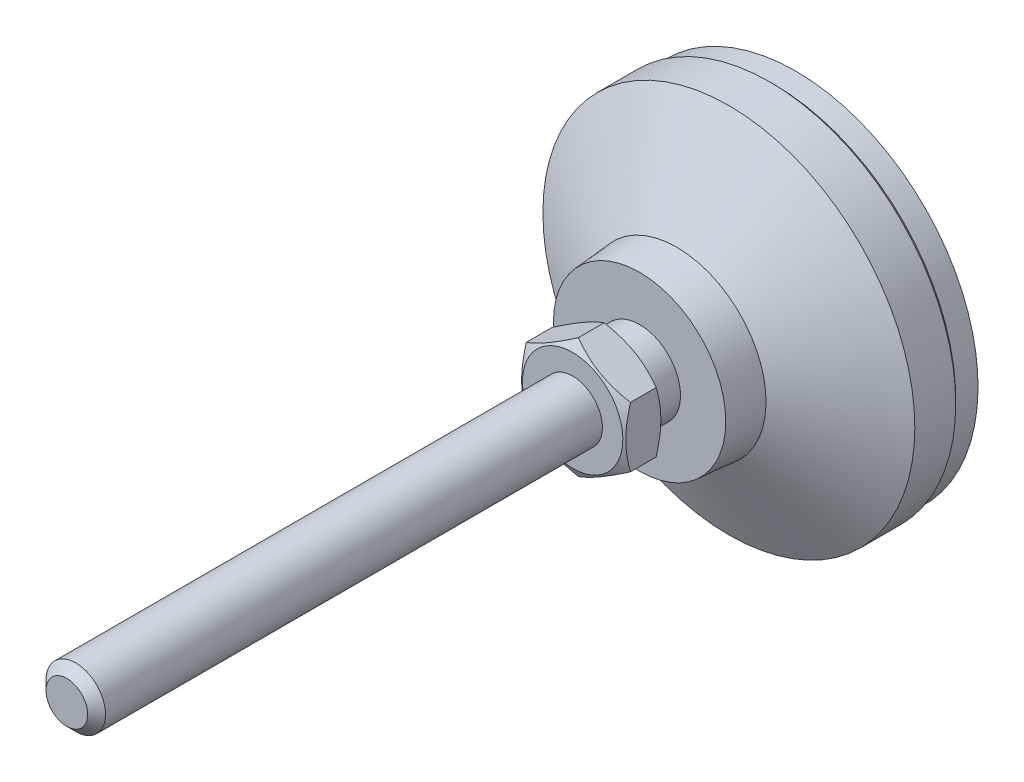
ISO-10303-21;
HEADER;
FILE_DESCRIPTION(('STEP AP214'),'2;1');
FILE_NAME('part.step','',(''),(''),'','','');
FILE_SCHEMA(('AUTOMOTIVE_DESIGN { 1 0 10303 214 1 1 1 1 }'));
ENDSEC;
DATA;
#1=APPLICATION_CONTEXT('core data for automotive mechanical design processes');
#2=APPLICATION_PROTOCOL_DEFINITION('international standard','automotive_design',2000,#1);
#3=PRODUCT_CONTEXT('',#1,'mechanical');
#4=PRODUCT('Part','Part','',(#3));
#5=PRODUCT_RELATED_PRODUCT_CATEGORY('part','',(#4));
#6=PRODUCT_DEFINITION_FORMATION('','',#4);
#7=PRODUCT_DEFINITION_CONTEXT('part definition',#1,'design');
#8=PRODUCT_DEFINITION('design','',#6,#7);
#9=PRODUCT_DEFINITION_SHAPE('','',#8);
#10=(LENGTH_UNIT() NAMED_UNIT(*) SI_UNIT(.MILLI.,.METRE.));
#11=(NAMED_UNIT(*) PLANE_ANGLE_UNIT() SI_UNIT($,.RADIAN.));
#12=(NAMED_UNIT(*) SI_UNIT($,.STERADIAN.) SOLID_ANGLE_UNIT());
#13=UNCERTAINTY_MEASURE_WITH_UNIT(LENGTH_MEASURE(1.E-05),#10,'distance_accuracy_value','');
#14=(GEOMETRIC_REPRESENTATION_CONTEXT(3) GLOBAL_UNCERTAINTY_ASSIGNED_CONTEXT((#13)) GLOBAL_UNIT_ASSIGNED_CONTEXT((#10,
#11,#12)) REPRESENTATION_CONTEXT('',''));
#15=CARTESIAN_POINT('',(0.,0.,0.));
#16=DIRECTION('',(0.,0.,1.));
#17=DIRECTION('',(1.,0.,0.));
#18=AXIS2_PLACEMENT_3D('',#15,#16,#17);
#19=CARTESIAN_POINT('',(0.,0.,2.));
#20=DIRECTION('',(0.,0.,-1.));
#21=DIRECTION('',(0.,1.,0.));
#22=AXIS2_PLACEMENT_3D('',#19,#20,#21);
#23=CYLINDRICAL_SURFACE('',#22,5.49999999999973);
#24=CARTESIAN_POINT('',(0.,0.,25.));
#25=DIRECTION('',(0.,0.,-1.));
#26=DIRECTION('',(0.,1.,0.));
#27=AXIS2_PLACEMENT_3D('',#24,#25,#26);
#28=CIRCLE('',#27,5.49999999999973);
#29=CARTESIAN_POINT('',(0.,5.49999999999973,25.));
#30=VERTEX_POINT('',#29);
#31=EDGE_CURVE('E100',#30,#30,#28,.T.);
#32=ORIENTED_EDGE('',*,*,#31,.T.);
#33=EDGE_LOOP('',(#32));
#34=FACE_BOUND('',#33,.T.);
#35=CARTESIAN_POINT('',(0.,0.,21.));
#36=DIRECTION('',(0.,0.,-1.));
#37=DIRECTION('',(0.,1.,0.));
#38=AXIS2_PLACEMENT_3D('',#35,#36,#37);
#39=CIRCLE('',#38,5.49999999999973);
#40=CARTESIAN_POINT('',(0.,5.49999999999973,21.));
#41=VERTEX_POINT('',#40);
#42=EDGE_CURVE('E93',#41,#41,#39,.T.);
#43=ORIENTED_EDGE('',*,*,#42,.F.);
#44=EDGE_LOOP('',(#43));
#45=FACE_BOUND('',#44,.T.);
#46=ADVANCED_FACE('F14',(#34,#45),#23,.T.);
#47=CARTESIAN_POINT('',(-5.49999999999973,0.,25.));
#48=DIRECTION('',(0.,0.,1.));
#49=DIRECTION('',(0.,-1.,0.));
#50=AXIS2_PLACEMENT_3D('',#47,#48,#49);
#51=PLANE('',#50);
#52=CARTESIAN_POINT('',(0.,0.,25.));
#53=DIRECTION('',(0.,0.,1.));
#54=DIRECTION('',(0.,-1.,0.));
#55=AXIS2_PLACEMENT_3D('',#52,#53,#54);
#56=CIRCLE('',#55,6.75);
#57=CARTESIAN_POINT('',(0.,-6.75,25.));
#58=VERTEX_POINT('',#57);
#59=EDGE_CURVE('E443',#58,#58,#56,.T.);
#60=ORIENTED_EDGE('',*,*,#59,.F.);
#61=EDGE_LOOP('',(#60));
#62=FACE_BOUND('',#61,.T.);
#63=ORIENTED_EDGE('',*,*,#31,.F.);
#64=EDGE_LOOP('',(#63));
#65=FACE_BOUND('',#64,.T.);
#66=ADVANCED_FACE('F137',(#62,#65),#51,.F.);
#67=CARTESIAN_POINT('',(0.,-5.49999999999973,21.));
#68=DIRECTION('',(0.,0.,1.));
#69=DIRECTION('',(0.,-1.,0.));
#70=AXIS2_PLACEMENT_3D('',#67,#68,#69);
#71=PLANE('',#70);
#72=ORIENTED_EDGE('',*,*,#42,.T.);
#73=EDGE_LOOP('',(#72));
#74=FACE_BOUND('',#73,.T.);
#75=CARTESIAN_POINT('',(0.,0.,21.));
#76=DIRECTION('',(0.,0.,1.));
#77=DIRECTION('',(0.,-1.,0.));
#78=AXIS2_PLACEMENT_3D('',#75,#76,#77);
#79=CIRCLE('',#78,11.5833333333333);
#80=CARTESIAN_POINT('',(0.,-11.5833333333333,21.));
#81=VERTEX_POINT('',#80);
#82=EDGE_CURVE('E88',#81,#81,#79,.T.);
#83=ORIENTED_EDGE('',*,*,#82,.T.);
#84=EDGE_LOOP('',(#83));
#85=FACE_BOUND('',#84,.T.);
#86=ADVANCED_FACE('F144',(#74,#85),#71,.T.);
#87=CARTESIAN_POINT('',(0.,0.,2.));
#88=DIRECTION('',(0.,0.,-1.));
#89=DIRECTION('',(0.,1.,0.));
#90=AXIS2_PLACEMENT_3D('',#87,#88,#89);
#91=CYLINDRICAL_SURFACE('',#90,25.);
#92=CARTESIAN_POINT('',(0.,0.,3.5));
#93=DIRECTION('',(0.,0.,-1.));
#94=DIRECTION('',(0.,1.,0.));
#95=AXIS2_PLACEMENT_3D('',#92,#93,#94);
#96=CIRCLE('',#95,25.);
#97=CARTESIAN_POINT('',(0.,25.,3.5));
#98=VERTEX_POINT('',#97);
#99=EDGE_CURVE('E28',#98,#98,#96,.F.);
#100=ORIENTED_EDGE('',*,*,#99,.T.);
#101=EDGE_LOOP('',(#100));
#102=FACE_BOUND('',#101,.T.);
#103=CARTESIAN_POINT('',(0.,0.,9.));
#104=DIRECTION('',(0.,0.,-1.));
#105=DIRECTION('',(0.,1.,0.));
#106=AXIS2_PLACEMENT_3D('',#103,#104,#105);
#107=CIRCLE('',#106,25.);
#108=CARTESIAN_POINT('',(0.,25.,9.));
#109=VERTEX_POINT('',#108);
#110=EDGE_CURVE('E106',#109,#109,#107,.T.);
#111=ORIENTED_EDGE('',*,*,#110,.T.);
#112=EDGE_LOOP('',(#111));
#113=FACE_BOUND('',#112,.T.);
#114=ADVANCED_FACE('F114',(#102,#113),#91,.T.);
#115=CARTESIAN_POINT('',(0.,0.,16.));
#116=DIRECTION('',(0.,0.,-1.));
#117=DIRECTION('',(0.,1.,0.));
#118=AXIS2_PLACEMENT_3D('',#115,#116,#117);
#119=CONICAL_SURFACE('',#118,12.,1.07685495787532);
#120=ORIENTED_EDGE('',*,*,#110,.F.);
#121=EDGE_LOOP('',(#120));
#122=FACE_BOUND('',#121,.T.);
#123=CARTESIAN_POINT('',(0.,0.,16.));
#124=DIRECTION('',(0.,0.,-1.));
#125=DIRECTION('',(0.,1.,0.));
#126=AXIS2_PLACEMENT_3D('',#123,#124,#125);
#127=CIRCLE('',#126,12.);
#128=CARTESIAN_POINT('',(0.,12.,16.));
#129=VERTEX_POINT('',#128);
#130=EDGE_CURVE('E103',#129,#129,#127,.T.);
#131=ORIENTED_EDGE('',*,*,#130,.T.);
#132=EDGE_LOOP('',(#131));
#133=FACE_BOUND('',#132,.T.);
#134=ADVANCED_FACE('F152',(#122,#133),#119,.T.);
#135=CARTESIAN_POINT('',(0.,0.,22.));
#136=DIRECTION('',(0.,0.,-1.));
#137=DIRECTION('',(0.,1.,0.));
#138=AXIS2_PLACEMENT_3D('',#135,#136,#137);
#139=CONICAL_SURFACE('',#138,11.5,0.0831412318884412);
#140=ORIENTED_EDGE('',*,*,#130,.F.);
#141=EDGE_LOOP('',(#140));
#142=FACE_BOUND('',#141,.T.);
#143=ORIENTED_EDGE('',*,*,#82,.F.);
#144=EDGE_LOOP('',(#143));
#145=FACE_BOUND('',#144,.T.);
#146=ADVANCED_FACE('F120',(#142,#145),#139,.T.);
#147=CARTESIAN_POINT('',(0.,0.,3.));
#148=DIRECTION('',(0.,0.,1.));
#149=DIRECTION('',(0.,-1.,0.));
#150=AXIS2_PLACEMENT_3D('',#147,#148,#149);
#151=CONICAL_SURFACE('',#150,24.5,0.785398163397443);
#152=ORIENTED_EDGE('',*,*,#99,.F.);
#153=EDGE_LOOP('',(#152));
#154=FACE_BOUND('',#153,.T.);
#155=CARTESIAN_POINT('',(0.,0.,3.));
#156=DIRECTION('',(0.,0.,-1.));
#157=DIRECTION('',(0.,1.,0.));
#158=AXIS2_PLACEMENT_3D('',#155,#156,#157);
#159=CIRCLE('',#158,24.5);
#160=CARTESIAN_POINT('',(0.,24.5,3.));
#161=VERTEX_POINT('',#160);
#162=EDGE_CURVE('E108',#161,#161,#159,.T.);
#163=ORIENTED_EDGE('',*,*,#162,.F.);
#164=EDGE_LOOP('',(#163));
#165=FACE_BOUND('',#164,.T.);
#166=ADVANCED_FACE('F16',(#154,#165),#151,.T.);
#167=CARTESIAN_POINT('',(0.,0.,0.));
#168=DIRECTION('',(0.,0.,1.));
#169=DIRECTION('',(0.,-1.,0.));
#170=AXIS2_PLACEMENT_3D('',#167,#168,#169);
#171=CYLINDRICAL_SURFACE('',#170,24.5);
#172=CARTESIAN_POINT('',(0.,0.,0.));
#173=DIRECTION('',(0.,0.,-1.));
#174=DIRECTION('',(0.,1.,0.));
#175=AXIS2_PLACEMENT_3D('',#172,#173,#174);
#176=CIRCLE('',#175,24.5);
#177=CARTESIAN_POINT('',(0.,24.5,0.));
#178=VERTEX_POINT('',#177);
#179=EDGE_CURVE('E260',#178,#178,#176,.T.);
#180=ORIENTED_EDGE('',*,*,#179,.F.);
#181=EDGE_LOOP('',(#180));
#182=FACE_BOUND('',#181,.T.);
#183=ORIENTED_EDGE('',*,*,#162,.T.);
#184=EDGE_LOOP('',(#183));
#185=FACE_BOUND('',#184,.T.);
#186=ADVANCED_FACE('F119',(#182,#185),#171,.T.);
#187=CARTESIAN_POINT('',(0.,0.,0.));
#188=DIRECTION('',(0.,0.,-1.));
#189=DIRECTION('',(0.,1.,0.));
#190=AXIS2_PLACEMENT_3D('',#187,#188,#189);
#191=PLANE('',#190);
#192=ORIENTED_EDGE('',*,*,#179,.T.);
#193=EDGE_LOOP('',(#192));
#194=FACE_BOUND('',#193,.T.);
#195=ADVANCED_FACE('F124',(#194),#191,.T.);
#196=CARTESIAN_POINT('',(0.,0.,25.));
#197=DIRECTION('',(0.,0.,1.));
#198=DIRECTION('',(0.,-1.,0.));
#199=AXIS2_PLACEMENT_3D('',#196,#197,#198);
#200=CONICAL_SURFACE('',#199,6.75,1.0471975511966);
#201=CARTESIAN_POINT('',(0.000200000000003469,-8.0830192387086,25.7696190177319));
#202=CARTESIAN_POINT('',(-0.15366790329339,-7.99418356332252,25.7183374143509));
#203=CARTESIAN_POINT('',(-0.308109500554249,-7.90501666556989,25.669383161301));
#204=CARTESIAN_POINT('',(-0.618246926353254,-7.72595873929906,25.5767703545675));
#205=CARTESIAN_POINT('',(-0.773943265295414,-7.63606741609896,25.5331140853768));
#206=CARTESIAN_POINT('',(-1.24352516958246,-7.36495417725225,25.4109491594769));
#207=CARTESIAN_POINT('',(-1.5592643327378,-7.18266208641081,25.3414631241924));
#208=CARTESIAN_POINT('',(-2.03176224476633,-6.90986528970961,25.2599825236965));
#209=CARTESIAN_POINT('',(-2.18710922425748,-6.82017566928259,25.2367710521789));
#210=CARTESIAN_POINT('',(-2.49850511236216,-6.64039116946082,25.1978487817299));
#211=CARTESIAN_POINT('',(-2.6545539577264,-6.55029632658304,25.1821373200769));
#212=CARTESIAN_POINT('',(-2.96692267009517,-6.36995016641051,25.1586154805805));
#213=CARTESIAN_POINT('',(-3.12324202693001,-6.27969914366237,25.1507961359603));
#214=CARTESIAN_POINT('',(-3.43601650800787,-6.09911871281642,25.1432178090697));
#215=CARTESIAN_POINT('',(-3.59247162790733,-6.00878930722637,25.1434585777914));
#216=CARTESIAN_POINT('',(-4.02110687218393,-5.76131663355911,25.155197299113));
#217=CARTESIAN_POINT('',(-4.29314668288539,-5.60425437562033,25.1749033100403));
#218=CARTESIAN_POINT('',(-4.83541944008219,-5.29117305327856,25.2373910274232));
#219=CARTESIAN_POINT('',(-5.10565047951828,-5.13515508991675,25.2801940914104));
#220=CARTESIAN_POINT('',(-5.64901454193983,-4.82144370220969,25.3871892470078));
#221=CARTESIAN_POINT('',(-5.92207900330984,-4.6637898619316,25.4518346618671));
#222=CARTESIAN_POINT('',(-6.46413578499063,-4.35083323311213,25.5985536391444));
#223=CARTESIAN_POINT('',(-6.73313504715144,-4.19552643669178,25.680592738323));
#224=CARTESIAN_POINT('',(-7.0002,-4.04133641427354,25.7696190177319));
#225=B_SPLINE_CURVE_WITH_KNOTS('',3,(#201,#202,#203,#204,#205,#206,#207,#208,#209,#210,#211,
#212,#213,#214,#215,#216,#217,#218,#219,#220,#221,#222,#223,#224),.UNSPECIFIED.,.F.,.F.,(4,2,2,
2,2,2,2,2,2,2,2,4),(0.,0.554727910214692,1.10969417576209,2.2219327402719,2.76443041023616,
3.30688013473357,3.84871284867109,4.39052882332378,5.33376515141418,6.27787517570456,
7.2429241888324,8.20607866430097),.UNSPECIFIED.);
#226=CARTESIAN_POINT('',(0.,-8.08290376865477,25.7695523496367));
#227=VERTEX_POINT('',#226);
#228=CARTESIAN_POINT('',(-7.,-4.04145188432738,25.7695523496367));
#229=VERTEX_POINT('',#228);
#230=EDGE_CURVE('E73',#227,#229,#225,.T.);
#231=ORIENTED_EDGE('',*,*,#230,.T.);
#232=CARTESIAN_POINT('',(-7.,10.8611447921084,28.5631016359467));
#233=CARTESIAN_POINT('',(-7.,10.5553635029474,28.4147489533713));
#234=CARTESIAN_POINT('',(-7.,10.2488808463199,28.2678171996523));
#235=CARTESIAN_POINT('',(-7.,9.63413982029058,27.9775946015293));
#236=CARTESIAN_POINT('',(-7.,9.32588118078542,27.8343043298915));
#237=CARTESIAN_POINT('',(-7.,8.70562954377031,27.5514440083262));
#238=CARTESIAN_POINT('',(-7.,8.39362535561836,27.4118984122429));
#239=CARTESIAN_POINT('',(-7.,7.76713731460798,27.1385107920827));
#240=CARTESIAN_POINT('',(-7.,7.45265357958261,27.0046684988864));
#241=CARTESIAN_POINT('',(-7.,6.81053581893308,26.7400011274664));
#242=CARTESIAN_POINT('',(-7.,6.48280417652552,26.609411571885));
#243=CARTESIAN_POINT('',(-7.,5.82350941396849,26.3581030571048));
#244=CARTESIAN_POINT('',(-7.,5.4919458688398,26.2373852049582));
#245=CARTESIAN_POINT('',(-7.,4.82507464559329,26.008985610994));
#246=CARTESIAN_POINT('',(-7.,4.48977608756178,25.9012775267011));
#247=CARTESIAN_POINT('',(-7.,3.81438128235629,25.7023487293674));
#248=CARTESIAN_POINT('',(-7.,3.47428658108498,25.6111228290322));
#249=CARTESIAN_POINT('',(-7.,2.79093814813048,25.4500242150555));
#250=CARTESIAN_POINT('',(-7.,2.44771250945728,25.3800355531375));
#251=CARTESIAN_POINT('',(-7.,1.92974425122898,25.294007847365));
#252=CARTESIAN_POINT('',(-7.,1.75655386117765,25.268489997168));
#253=CARTESIAN_POINT('',(-7.,1.4093104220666,25.2242731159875));
#254=CARTESIAN_POINT('',(-7.,1.2352574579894,25.2055734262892));
#255=CARTESIAN_POINT('',(-7.,0.888798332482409,25.175600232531));
#256=CARTESIAN_POINT('',(-7.,0.716400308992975,25.1642330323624));
#257=CARTESIAN_POINT('',(-7.,0.371278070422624,25.1487993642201));
#258=CARTESIAN_POINT('',(-7.,0.19855386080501,25.1447327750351));
#259=CARTESIAN_POINT('',(-7.,-0.146911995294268,25.1439973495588));
#260=CARTESIAN_POINT('',(-7.,-0.319653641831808,25.1473285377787));
#261=CARTESIAN_POINT('',(-7.,-0.664842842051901,25.1613072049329));
#262=CARTESIAN_POINT('',(-7.,-0.837290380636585,25.1719550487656));
#263=CARTESIAN_POINT('',(-7.,-1.25156928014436,25.2060982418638));
#264=CARTESIAN_POINT('',(-7.,-1.49312131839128,25.2330559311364));
#265=CARTESIAN_POINT('',(-7.,-1.97442477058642,25.2998573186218));
#266=CARTESIAN_POINT('',(-7.,-2.21417593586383,25.339702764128));
#267=CARTESIAN_POINT('',(-7.,-2.93045825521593,25.4764572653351));
#268=CARTESIAN_POINT('',(-7.,-3.40374984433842,25.5905594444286));
#269=CARTESIAN_POINT('',(-7.,-4.11145796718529,25.7883300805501));
#270=CARTESIAN_POINT('',(-7.,-4.34954757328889,25.8596098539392));
#271=CARTESIAN_POINT('',(-7.,-4.82341412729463,26.0095499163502));
#272=CARTESIAN_POINT('',(-7.,-5.05919105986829,26.0882102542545));
#273=CARTESIAN_POINT('',(-7.,-5.52850690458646,26.2516512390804));
#274=CARTESIAN_POINT('',(-7.,-5.7620465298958,26.3364298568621));
#275=CARTESIAN_POINT('',(-7.,-6.22719230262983,26.5111121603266));
#276=CARTESIAN_POINT('',(-7.,-6.45879847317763,26.6010157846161));
#277=CARTESIAN_POINT('',(-7.,-7.00730549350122,26.8198043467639));
#278=CARTESIAN_POINT('',(-7.,-7.32344040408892,26.9506060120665));
#279=CARTESIAN_POINT('',(-7.,-7.95300689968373,27.2185796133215));
#280=CARTESIAN_POINT('',(-7.,-8.26643831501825,27.3557519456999));
#281=CARTESIAN_POINT('',(-7.,-8.89109817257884,27.6351808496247));
#282=CARTESIAN_POINT('',(-7.,-9.20232614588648,27.7774384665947));
#283=CARTESIAN_POINT('',(-7.,-9.8228969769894,28.0660149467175));
#284=CARTESIAN_POINT('',(-7.,-10.1322397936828,28.2123338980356));
#285=CARTESIAN_POINT('',(-7.,-10.7496791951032,28.5084244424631));
#286=CARTESIAN_POINT('',(-7.,-11.0577740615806,28.6581996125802));
#287=CARTESIAN_POINT('',(-7.,-11.6726326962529,28.9604602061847));
#288=CARTESIAN_POINT('',(-7.,-11.9793964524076,29.1129456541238));
#289=CARTESIAN_POINT('',(-7.,-12.8979273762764,29.5737016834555));
#290=CARTESIAN_POINT('',(-7.,-13.5080186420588,29.8853127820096));
#291=CARTESIAN_POINT('',(-7.,-14.6735181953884,30.4881810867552));
#292=CARTESIAN_POINT('',(-7.,-15.2291894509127,30.7789321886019));
#293=CARTESIAN_POINT('',(-7.,-16.3384711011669,31.3643849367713));
#294=CARTESIAN_POINT('',(-7.,-16.8920814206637,31.6590867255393));
#295=CARTESIAN_POINT('',(-7.,-17.9962998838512,32.2507483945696));
#296=CARTESIAN_POINT('',(-7.,-18.546912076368,32.5477007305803));
#297=CARTESIAN_POINT('',(-7.,-19.6468201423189,33.1439612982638));
#298=CARTESIAN_POINT('',(-7.,-20.1961160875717,33.4432693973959));
#299=CARTESIAN_POINT('',(-7.,-20.7449282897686,33.7434559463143));
#300=B_SPLINE_CURVE_WITH_KNOTS('',3,(#232,#233,#234,#235,#236,#237,#238,#239,#240,#241,#242,
#243,#244,#245,#246,#247,#248,#249,#250,#251,#252,#253,#254,#255,#256,#257,#258,#259,#260,#261,
#262,#263,#264,#265,#266,#267,#268,#269,#270,#271,#272,#273,#274,#275,#276,#277,#278,#279,#280,
#281,#282,#283,#284,#285,#286,#287,#288,#289,#290,#291,#292,#293,#294,#295,#296,#297,#298,#299),
.UNSPECIFIED.,.F.,.F.,(4,2,2,2,2,2,2,2,2,2,2,2,2,2,2,2,2,2,2,2,2,2,2,2,2,2,2,2,2,2,2,2,2,4),(0.,
1.01961844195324,2.03939627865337,3.06471694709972,4.0899891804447,5.14823950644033,
6.20660834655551,7.2627969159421,8.31865249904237,9.36863520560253,9.89370270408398,
10.4187194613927,10.9368870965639,11.4550461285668,11.9732068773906,12.4913934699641,
13.2201367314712,13.9489788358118,15.4074680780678,16.1529979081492,16.8985326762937,
17.6438213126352,18.3891010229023,19.4153852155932,20.4417333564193,21.4682937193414,
22.4948763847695,23.5225739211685,24.5502807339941,26.6054130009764,28.4868212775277,
30.3682975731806,32.2450414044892,34.1216803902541),.UNSPECIFIED.);
#301=CARTESIAN_POINT('',(-7.,4.04145188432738,25.7695523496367));
#302=VERTEX_POINT('',#301);
#303=EDGE_CURVE('E81',#229,#302,#300,.F.);
#304=ORIENTED_EDGE('',*,*,#303,.T.);
#305=CARTESIAN_POINT('',(-7.0002,4.04133641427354,25.7696190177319));
#306=CARTESIAN_POINT('',(-6.84633209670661,4.13017208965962,25.7183374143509));
#307=CARTESIAN_POINT('',(-6.69189049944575,4.21933898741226,25.669383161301));
#308=CARTESIAN_POINT('',(-6.38175307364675,4.39839691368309,25.5767703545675));
#309=CARTESIAN_POINT('',(-6.22605673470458,4.48828823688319,25.5331140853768));
#310=CARTESIAN_POINT('',(-5.75647483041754,4.75940147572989,25.4109491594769));
#311=CARTESIAN_POINT('',(-5.4407356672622,4.94169356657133,25.3414631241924));
#312=CARTESIAN_POINT('',(-4.96823775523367,5.21449036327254,25.2599825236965));
#313=CARTESIAN_POINT('',(-4.81289077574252,5.30417998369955,25.2367710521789));
#314=CARTESIAN_POINT('',(-4.50149488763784,5.48396448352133,25.1978487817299));
#315=CARTESIAN_POINT('',(-4.34544604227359,5.57405932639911,25.1821373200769));
#316=CARTESIAN_POINT('',(-4.03307732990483,5.75440548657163,25.1586154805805));
#317=CARTESIAN_POINT('',(-3.87675797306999,5.84465650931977,25.1507961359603));
#318=CARTESIAN_POINT('',(-3.56398349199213,6.02523694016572,25.1432178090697));
#319=CARTESIAN_POINT('',(-3.40752837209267,6.11556634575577,25.1434585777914));
#320=CARTESIAN_POINT('',(-2.97889312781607,6.36303901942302,25.155197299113));
#321=CARTESIAN_POINT('',(-2.7068533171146,6.52010127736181,25.1749033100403));
#322=CARTESIAN_POINT('',(-2.16458055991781,6.83318259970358,25.2373910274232));
#323=CARTESIAN_POINT('',(-1.89434952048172,6.9892005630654,25.2801940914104));
#324=CARTESIAN_POINT('',(-1.35098545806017,7.30291195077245,25.3871892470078));
#325=CARTESIAN_POINT('',(-1.07792099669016,7.46056579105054,25.4518346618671));
#326=CARTESIAN_POINT('',(-0.535864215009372,7.77352241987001,25.5985536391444));
#327=CARTESIAN_POINT('',(-0.266864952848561,7.92882921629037,25.680592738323));
#328=CARTESIAN_POINT('',(0.000199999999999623,8.0830192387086,25.7696190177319));
#329=B_SPLINE_CURVE_WITH_KNOTS('',3,(#305,#306,#307,#308,#309,#310,#311,#312,#313,#314,#315,
#316,#317,#318,#319,#320,#321,#322,#323,#324,#325,#326,#327,#328),.UNSPECIFIED.,.F.,.F.,(4,2,2,
2,2,2,2,2,2,2,2,4),(0.,0.554727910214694,1.10969417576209,2.2219327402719,2.76443041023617,
3.30688013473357,3.84871284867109,4.39052882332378,5.33376515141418,6.27787517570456,
7.2429241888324,8.20607866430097),.UNSPECIFIED.);
#330=CARTESIAN_POINT('',(0.,8.08290376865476,25.7695523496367));
#331=VERTEX_POINT('',#330);
#332=EDGE_CURVE('E195',#302,#331,#329,.T.);
#333=ORIENTED_EDGE('',*,*,#332,.T.);
#334=CARTESIAN_POINT('',(-0.000200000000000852,8.0830192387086,25.7696190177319));
#335=CARTESIAN_POINT('',(0.153667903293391,7.99418356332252,25.7183374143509));
#336=CARTESIAN_POINT('',(0.30810950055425,7.90501666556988,25.669383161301));
#337=CARTESIAN_POINT('',(0.618246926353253,7.72595873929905,25.5767703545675));
#338=CARTESIAN_POINT('',(0.773943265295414,7.63606741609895,25.5331140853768));
#339=CARTESIAN_POINT('',(1.24352516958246,7.36495417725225,25.4109491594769));
#340=CARTESIAN_POINT('',(1.5592643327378,7.18266208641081,25.3414631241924));
#341=CARTESIAN_POINT('',(2.03176224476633,6.9098652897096,25.2599825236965));
#342=CARTESIAN_POINT('',(2.18710922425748,6.82017566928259,25.2367710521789));
#343=CARTESIAN_POINT('',(2.49850511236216,6.64039116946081,25.1978487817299));
#344=CARTESIAN_POINT('',(2.65455395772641,6.55029632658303,25.1821373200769));
#345=CARTESIAN_POINT('',(2.96692267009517,6.36995016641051,25.1586154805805));
#346=CARTESIAN_POINT('',(3.12324202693,6.27969914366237,25.1507961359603));
#347=CARTESIAN_POINT('',(3.43601650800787,6.09911871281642,25.1432178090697));
#348=CARTESIAN_POINT('',(3.59247162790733,6.00878930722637,25.1434585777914));
#349=CARTESIAN_POINT('',(4.02110687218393,5.76131663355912,25.155197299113));
#350=CARTESIAN_POINT('',(4.2931466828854,5.60425437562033,25.1749033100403));
#351=CARTESIAN_POINT('',(4.83541944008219,5.29117305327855,25.2373910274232));
#352=CARTESIAN_POINT('',(5.10565047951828,5.13515508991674,25.2801940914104));
#353=CARTESIAN_POINT('',(5.64901454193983,4.82144370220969,25.3871892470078));
#354=CARTESIAN_POINT('',(5.92207900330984,4.66378986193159,25.4518346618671));
#355=CARTESIAN_POINT('',(6.46413578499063,4.35083323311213,25.5985536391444));
#356=CARTESIAN_POINT('',(6.73313504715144,4.19552643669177,25.680592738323));
#357=CARTESIAN_POINT('',(7.0002,4.04133641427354,25.7696190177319));
#358=B_SPLINE_CURVE_WITH_KNOTS('',3,(#334,#335,#336,#337,#338,#339,#340,#341,#342,#343,#344,
#345,#346,#347,#348,#349,#350,#351,#352,#353,#354,#355,#356,#357),.UNSPECIFIED.,.F.,.F.,(4,2,2,
2,2,2,2,2,2,2,2,4),(0.,0.554727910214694,1.10969417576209,2.2219327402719,2.76443041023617,
3.30688013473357,3.84871284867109,4.39052882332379,5.33376515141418,6.27787517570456,
7.2429241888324,8.20607866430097),.UNSPECIFIED.);
#359=CARTESIAN_POINT('',(7.,4.04145188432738,25.7695523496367));
#360=VERTEX_POINT('',#359);
#361=EDGE_CURVE('E223',#331,#360,#358,.T.);
#362=ORIENTED_EDGE('',*,*,#361,.T.);
#363=CARTESIAN_POINT('',(7.,10.8611447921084,28.5631016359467));
#364=CARTESIAN_POINT('',(7.,10.5553635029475,28.4147489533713));
#365=CARTESIAN_POINT('',(7.,10.2488808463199,28.2678171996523));
#366=CARTESIAN_POINT('',(7.,9.6341398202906,27.9775946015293));
#367=CARTESIAN_POINT('',(7.,9.32588118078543,27.8343043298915));
#368=CARTESIAN_POINT('',(7.,8.70562954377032,27.5514440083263));
#369=CARTESIAN_POINT('',(7.,8.39362535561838,27.4118984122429));
#370=CARTESIAN_POINT('',(7.,7.76713731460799,27.1385107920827));
#371=CARTESIAN_POINT('',(7.,7.45265357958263,27.0046684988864));
#372=CARTESIAN_POINT('',(7.,6.81053581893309,26.7400011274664));
#373=CARTESIAN_POINT('',(7.,6.48280417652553,26.609411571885));
#374=CARTESIAN_POINT('',(7.,5.8235094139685,26.3581030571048));
#375=CARTESIAN_POINT('',(7.,5.49194586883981,26.2373852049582));
#376=CARTESIAN_POINT('',(7.,4.8250746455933,26.008985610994));
#377=CARTESIAN_POINT('',(7.,4.48977608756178,25.9012775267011));
#378=CARTESIAN_POINT('',(7.,3.8143812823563,25.7023487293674));
#379=CARTESIAN_POINT('',(7.,3.47428658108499,25.6111228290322));
#380=CARTESIAN_POINT('',(7.,2.79093814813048,25.4500242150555));
#381=CARTESIAN_POINT('',(7.,2.44771250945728,25.3800355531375));
#382=CARTESIAN_POINT('',(7.,1.92974425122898,25.294007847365));
#383=CARTESIAN_POINT('',(7.,1.75655386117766,25.268489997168));
#384=CARTESIAN_POINT('',(7.,1.4093104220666,25.2242731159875));
#385=CARTESIAN_POINT('',(7.,1.2352574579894,25.2055734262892));
#386=CARTESIAN_POINT('',(7.,0.888798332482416,25.175600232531));
#387=CARTESIAN_POINT('',(7.,0.716400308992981,25.1642330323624));
#388=CARTESIAN_POINT('',(7.,0.371278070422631,25.1487993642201));
#389=CARTESIAN_POINT('',(7.,0.198553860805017,25.1447327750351));
#390=CARTESIAN_POINT('',(7.,-0.14691199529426,25.1439973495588));
#391=CARTESIAN_POINT('',(7.,-0.319653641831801,25.1473285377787));
#392=CARTESIAN_POINT('',(7.,-0.664842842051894,25.1613072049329));
#393=CARTESIAN_POINT('',(7.,-0.837290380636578,25.1719550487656));
#394=CARTESIAN_POINT('',(7.,-1.25156928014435,25.2060982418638));
#395=CARTESIAN_POINT('',(7.,-1.49312131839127,25.2330559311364));
#396=CARTESIAN_POINT('',(7.,-1.97442477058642,25.2998573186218));
#397=CARTESIAN_POINT('',(7.,-2.21417593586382,25.339702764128));
#398=CARTESIAN_POINT('',(7.,-2.93045825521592,25.4764572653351));
#399=CARTESIAN_POINT('',(7.,-3.40374984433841,25.5905594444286));
#400=CARTESIAN_POINT('',(7.,-4.11145796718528,25.7883300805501));
#401=CARTESIAN_POINT('',(7.,-4.34954757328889,25.8596098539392));
#402=CARTESIAN_POINT('',(7.,-4.82341412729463,26.0095499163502));
#403=CARTESIAN_POINT('',(7.,-5.05919105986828,26.0882102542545));
#404=CARTESIAN_POINT('',(7.,-5.52850690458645,26.2516512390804));
#405=CARTESIAN_POINT('',(7.,-5.76204652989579,26.3364298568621));
#406=CARTESIAN_POINT('',(7.,-6.22719230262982,26.5111121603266));
#407=CARTESIAN_POINT('',(7.,-6.45879847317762,26.6010157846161));
#408=CARTESIAN_POINT('',(7.,-7.00730549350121,26.8198043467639));
#409=CARTESIAN_POINT('',(7.,-7.32344040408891,26.9506060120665));
#410=CARTESIAN_POINT('',(7.,-7.95300689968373,27.2185796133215));
#411=CARTESIAN_POINT('',(7.,-8.26643831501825,27.3557519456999));
#412=CARTESIAN_POINT('',(7.,-8.89109817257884,27.6351808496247));
#413=CARTESIAN_POINT('',(7.,-9.20232614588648,27.7774384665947));
#414=CARTESIAN_POINT('',(7.,-9.8228969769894,28.0660149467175));
#415=CARTESIAN_POINT('',(7.,-10.1322397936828,28.2123338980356));
#416=CARTESIAN_POINT('',(7.,-10.7496791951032,28.5084244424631));
#417=CARTESIAN_POINT('',(7.,-11.0577740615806,28.6581996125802));
#418=CARTESIAN_POINT('',(7.,-11.6726326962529,28.9604602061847));
#419=CARTESIAN_POINT('',(7.,-11.9793964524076,29.1129456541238));
#420=CARTESIAN_POINT('',(7.,-12.8979273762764,29.5737016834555));
#421=CARTESIAN_POINT('',(7.,-13.5080186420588,29.8853127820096));
#422=CARTESIAN_POINT('',(7.,-14.6735181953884,30.4881810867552));
#423=CARTESIAN_POINT('',(7.,-15.2291894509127,30.7789321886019));
#424=CARTESIAN_POINT('',(7.,-16.3384711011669,31.3643849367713));
#425=CARTESIAN_POINT('',(7.,-16.8920814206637,31.6590867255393));
#426=CARTESIAN_POINT('',(7.,-17.9962998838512,32.2507483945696));
#427=CARTESIAN_POINT('',(7.,-18.546912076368,32.5477007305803));
#428=CARTESIAN_POINT('',(7.,-19.6468201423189,33.1439612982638));
#429=CARTESIAN_POINT('',(7.,-20.1961160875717,33.4432693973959));
#430=CARTESIAN_POINT('',(7.,-20.7449282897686,33.7434559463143));
#431=B_SPLINE_CURVE_WITH_KNOTS('',3,(#363,#364,#365,#366,#367,#368,#369,#370,#371,#372,#373,
#374,#375,#376,#377,#378,#379,#380,#381,#382,#383,#384,#385,#386,#387,#388,#389,#390,#391,#392,
#393,#394,#395,#396,#397,#398,#399,#400,#401,#402,#403,#404,#405,#406,#407,#408,#409,#410,#411,
#412,#413,#414,#415,#416,#417,#418,#419,#420,#421,#422,#423,#424,#425,#426,#427,#428,#429,#430),
.UNSPECIFIED.,.F.,.F.,(4,2,2,2,2,2,2,2,2,2,2,2,2,2,2,2,2,2,2,2,2,2,2,2,2,2,2,2,2,2,2,2,2,4),(0.,
1.01961844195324,2.03939627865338,3.06471694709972,4.08998918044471,5.14823950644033,
6.20660834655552,7.26279691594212,8.31865249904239,9.36863520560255,9.89370270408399,
10.4187194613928,10.9368870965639,11.4550461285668,11.9732068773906,12.4913934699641,
13.2201367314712,13.9489788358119,15.4074680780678,16.1529979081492,16.8985326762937,
17.6438213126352,18.3891010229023,19.4153852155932,20.4417333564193,21.4682937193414,
22.4948763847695,23.5225739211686,24.5502807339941,26.6054130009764,28.4868212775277,
30.3682975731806,32.2450414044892,34.1216803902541),.UNSPECIFIED.);
#432=CARTESIAN_POINT('',(7.,-4.04145188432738,25.7695523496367));
#433=VERTEX_POINT('',#432);
#434=EDGE_CURVE('E34',#360,#433,#431,.T.);
#435=ORIENTED_EDGE('',*,*,#434,.T.);
#436=CARTESIAN_POINT('',(7.0002,-4.04133641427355,25.7696190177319));
#437=CARTESIAN_POINT('',(6.84633209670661,-4.13017208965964,25.7183374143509));
#438=CARTESIAN_POINT('',(6.69189049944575,-4.21933898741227,25.669383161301));
#439=CARTESIAN_POINT('',(6.38175307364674,-4.3983969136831,25.5767703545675));
#440=CARTESIAN_POINT('',(6.22605673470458,-4.4882882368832,25.5331140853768));
#441=CARTESIAN_POINT('',(5.75647483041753,-4.7594014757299,25.4109491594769));
#442=CARTESIAN_POINT('',(5.4407356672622,-4.94169356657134,25.3414631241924));
#443=CARTESIAN_POINT('',(4.96823775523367,-5.21449036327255,25.2599825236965));
#444=CARTESIAN_POINT('',(4.81289077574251,-5.30417998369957,25.2367710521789));
#445=CARTESIAN_POINT('',(4.50149488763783,-5.48396448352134,25.1978487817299));
#446=CARTESIAN_POINT('',(4.34544604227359,-5.57405932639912,25.1821373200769));
#447=CARTESIAN_POINT('',(4.03307732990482,-5.75440548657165,25.1586154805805));
#448=CARTESIAN_POINT('',(3.87675797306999,-5.84465650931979,25.1507961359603));
#449=CARTESIAN_POINT('',(3.56398349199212,-6.02523694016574,25.1432178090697));
#450=CARTESIAN_POINT('',(3.40752837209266,-6.11556634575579,25.1434585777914));
#451=CARTESIAN_POINT('',(2.97889312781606,-6.36303901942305,25.155197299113));
#452=CARTESIAN_POINT('',(2.7068533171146,-6.52010127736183,25.1749033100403));
#453=CARTESIAN_POINT('',(2.1645805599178,-6.8331825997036,25.2373910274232));
#454=CARTESIAN_POINT('',(1.89434952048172,-6.98920056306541,25.2801940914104));
#455=CARTESIAN_POINT('',(1.35098545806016,-7.30291195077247,25.3871892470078));
#456=CARTESIAN_POINT('',(1.07792099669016,-7.46056579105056,25.4518346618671));
#457=CARTESIAN_POINT('',(0.535864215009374,-7.77352241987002,25.5985536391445));
#458=CARTESIAN_POINT('',(0.266864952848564,-7.92882921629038,25.680592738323));
#459=CARTESIAN_POINT('',(-0.000199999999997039,-8.08301923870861,25.7696190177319));
#460=B_SPLINE_CURVE_WITH_KNOTS('',3,(#436,#437,#438,#439,#440,#441,#442,#443,#444,#445,#446,
#447,#448,#449,#450,#451,#452,#453,#454,#455,#456,#457,#458,#459),.UNSPECIFIED.,.F.,.F.,(4,2,2,
2,2,2,2,2,2,2,2,4),(0.,0.554727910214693,1.10969417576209,2.2219327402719,2.76443041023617,
3.30688013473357,3.8487128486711,4.39052882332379,5.33376515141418,6.27787517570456,
7.2429241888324,8.20607866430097),.UNSPECIFIED.);
#461=EDGE_CURVE('E9',#433,#227,#460,.T.);
#462=ORIENTED_EDGE('',*,*,#461,.T.);
#463=EDGE_LOOP('',(#231,#304,#333,#362,#435,#462));
#464=FACE_BOUND('',#463,.T.);
#465=ORIENTED_EDGE('',*,*,#59,.T.);
#466=EDGE_LOOP('',(#465));
#467=FACE_BOUND('',#466,.T.);
#468=ADVANCED_FACE('F71',(#464,#467),#200,.T.);
#469=CARTESIAN_POINT('',(0.,0.,98.));
#470=DIRECTION('',(0.,0.,-1.));
#471=DIRECTION('',(0.,1.,0.));
#472=AXIS2_PLACEMENT_3D('',#469,#470,#471);
#473=PLANE('',#472);
#474=CARTESIAN_POINT('',(0.,0.,98.));
#475=DIRECTION('',(0.,0.,-1.));
#476=DIRECTION('',(0.,1.,0.));
#477=AXIS2_PLACEMENT_3D('',#474,#475,#476);
#478=CIRCLE('',#477,2.79999999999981);
#479=CARTESIAN_POINT('',(0.,2.79999999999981,98.));
#480=VERTEX_POINT('',#479);
#481=EDGE_CURVE('E293',#480,#480,#478,.T.);
#482=ORIENTED_EDGE('',*,*,#481,.F.);
#483=EDGE_LOOP('',(#482));
#484=FACE_BOUND('',#483,.T.);
#485=ADVANCED_FACE('F170',(#484),#473,.F.);
#486=CARTESIAN_POINT('',(0.,0.,98.));
#487=DIRECTION('',(0.,0.,-1.));
#488=DIRECTION('',(0.,1.,0.));
#489=AXIS2_PLACEMENT_3D('',#486,#487,#488);
#490=CONICAL_SURFACE('',#489,2.79999999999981,0.785398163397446);
#491=CARTESIAN_POINT('',(0.,0.,96.8));
#492=DIRECTION('',(0.,0.,-1.));
#493=DIRECTION('',(0.,1.,0.));
#494=AXIS2_PLACEMENT_3D('',#491,#492,#493);
#495=CIRCLE('',#494,3.99999999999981);
#496=CARTESIAN_POINT('',(0.,3.99999999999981,96.8));
#497=VERTEX_POINT('',#496);
#498=EDGE_CURVE('E262',#497,#497,#495,.T.);
#499=ORIENTED_EDGE('',*,*,#498,.F.);
#500=EDGE_LOOP('',(#499));
#501=FACE_BOUND('',#500,.T.);
#502=ORIENTED_EDGE('',*,*,#481,.T.);
#503=EDGE_LOOP('',(#502));
#504=FACE_BOUND('',#503,.T.);
#505=ADVANCED_FACE('F277',(#501,#504),#490,.T.);
#506=CARTESIAN_POINT('',(0.,0.,2.));
#507=DIRECTION('',(0.,0.,-1.));
#508=DIRECTION('',(0.,1.,0.));
#509=AXIS2_PLACEMENT_3D('',#506,#507,#508);
#510=CYLINDRICAL_SURFACE('',#509,3.99999999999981);
#511=CARTESIAN_POINT('',(0.,0.,30.));
#512=DIRECTION('',(0.,0.,-1.));
#513=DIRECTION('',(0.,1.,0.));
#514=AXIS2_PLACEMENT_3D('',#511,#512,#513);
#515=CIRCLE('',#514,3.99999999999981);
#516=CARTESIAN_POINT('',(0.,3.99999999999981,30.));
#517=VERTEX_POINT('',#516);
#518=EDGE_CURVE('E97',#517,#517,#515,.T.);
#519=ORIENTED_EDGE('',*,*,#518,.F.);
#520=EDGE_LOOP('',(#519));
#521=FACE_BOUND('',#520,.T.);
#522=ORIENTED_EDGE('',*,*,#498,.T.);
#523=EDGE_LOOP('',(#522));
#524=FACE_BOUND('',#523,.T.);
#525=ADVANCED_FACE('F273',(#521,#524),#510,.T.);
#526=CARTESIAN_POINT('',(-3.99999999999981,0.,30.));
#527=DIRECTION('',(0.,0.,-1.));
#528=DIRECTION('',(0.,1.,0.));
#529=AXIS2_PLACEMENT_3D('',#526,#527,#528);
#530=PLANE('',#529);
#531=CARTESIAN_POINT('',(0.,0.,30.));
#532=DIRECTION('',(0.,0.,1.));
#533=DIRECTION('',(0.,-1.,0.));
#534=AXIS2_PLACEMENT_3D('',#531,#532,#533);
#535=CIRCLE('',#534,6.75);
#536=CARTESIAN_POINT('',(0.,-6.75,30.));
#537=VERTEX_POINT('',#536);
#538=EDGE_CURVE('E80',#537,#537,#535,.T.);
#539=ORIENTED_EDGE('',*,*,#538,.T.);
#540=EDGE_LOOP('',(#539));
#541=FACE_BOUND('',#540,.T.);
#542=ORIENTED_EDGE('',*,*,#518,.T.);
#543=EDGE_LOOP('',(#542));
#544=FACE_BOUND('',#543,.T.);
#545=ADVANCED_FACE('F276',(#541,#544),#530,.F.);
#546=CARTESIAN_POINT('',(0.,0.,28.0625741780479));
#547=DIRECTION('',(0.,0.,-1.));
#548=DIRECTION('',(0.,1.,0.));
#549=AXIS2_PLACEMENT_3D('',#546,#547,#548);
#550=CONICAL_SURFACE('',#549,10.105719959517,1.0471975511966);
#551=CARTESIAN_POINT('',(-7.0002,-4.04133641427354,29.2303809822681));
#552=CARTESIAN_POINT('',(-6.84633209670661,-4.13017208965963,29.2816625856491));
#553=CARTESIAN_POINT('',(-6.69189049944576,-4.21933898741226,29.330616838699));
#554=CARTESIAN_POINT('',(-6.38175307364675,-4.39839691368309,29.4232296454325));
#555=CARTESIAN_POINT('',(-6.22605673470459,-4.48828823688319,29.4668859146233));
#556=CARTESIAN_POINT('',(-5.75647483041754,-4.75940147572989,29.5890508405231));
#557=CARTESIAN_POINT('',(-5.4407356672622,-4.94169356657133,29.6585368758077));
#558=CARTESIAN_POINT('',(-4.96823775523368,-5.21449036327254,29.7400174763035));
#559=CARTESIAN_POINT('',(-4.81289077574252,-5.30417998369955,29.7632289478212));
#560=CARTESIAN_POINT('',(-4.50149488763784,-5.48396448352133,29.8021512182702));
#561=CARTESIAN_POINT('',(-4.3454460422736,-5.57405932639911,29.8178626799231));
#562=CARTESIAN_POINT('',(-4.03307732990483,-5.75440548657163,29.8413845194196));
#563=CARTESIAN_POINT('',(-3.87675797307,-5.84465650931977,29.8492038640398));
#564=CARTESIAN_POINT('',(-3.56398349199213,-6.02523694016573,29.8567821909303));
#565=CARTESIAN_POINT('',(-3.40752837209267,-6.11556634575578,29.8565414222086));
#566=CARTESIAN_POINT('',(-2.97889312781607,-6.36303901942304,29.844802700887));
#567=CARTESIAN_POINT('',(-2.7068533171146,-6.52010127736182,29.8250966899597));
#568=CARTESIAN_POINT('',(-2.1645805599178,-6.83318259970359,29.7626089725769));
#569=CARTESIAN_POINT('',(-1.89434952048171,-6.98920056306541,29.7198059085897));
#570=CARTESIAN_POINT('',(-1.35098545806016,-7.30291195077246,29.6128107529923));
#571=CARTESIAN_POINT('',(-1.07792099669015,-7.46056579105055,29.548165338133));
#572=CARTESIAN_POINT('',(-0.535864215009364,-7.77352241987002,29.4014463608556));
#573=CARTESIAN_POINT('',(-0.266864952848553,-7.92882921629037,29.3194072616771));
#574=CARTESIAN_POINT('',(0.000200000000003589,-8.0830192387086,29.2303809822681));
#575=B_SPLINE_CURVE_WITH_KNOTS('',3,(#551,#552,#553,#554,#555,#556,#557,#558,#559,#560,#561,
#562,#563,#564,#565,#566,#567,#568,#569,#570,#571,#572,#573,#574),.UNSPECIFIED.,.F.,.F.,(4,2,2,
2,2,2,2,2,2,2,2,4),(0.,0.5547279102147,1.1096941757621,2.2219327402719,2.76443041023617,
3.30688013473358,3.8487128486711,4.3905288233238,5.3337651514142,6.27787517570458,
7.24292418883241,8.20607866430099),.UNSPECIFIED.);
#576=CARTESIAN_POINT('',(-7.,-4.04145188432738,29.2304476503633));
#577=VERTEX_POINT('',#576);
#578=CARTESIAN_POINT('',(0.,-8.08290376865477,29.2304476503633));
#579=VERTEX_POINT('',#578);
#580=EDGE_CURVE('E259',#577,#579,#575,.T.);
#581=ORIENTED_EDGE('',*,*,#580,.T.);
#582=CARTESIAN_POINT('',(-0.000199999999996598,-8.08301923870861,29.2303809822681));
#583=CARTESIAN_POINT('',(0.15366790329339,-7.99418356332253,29.2816625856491));
#584=CARTESIAN_POINT('',(0.308109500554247,-7.9050166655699,29.330616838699));
#585=CARTESIAN_POINT('',(0.618246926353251,-7.72595873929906,29.4232296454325));
#586=CARTESIAN_POINT('',(0.773943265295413,-7.63606741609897,29.4668859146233));
#587=CARTESIAN_POINT('',(1.24352516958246,-7.36495417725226,29.5890508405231));
#588=CARTESIAN_POINT('',(1.5592643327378,-7.18266208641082,29.6585368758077));
#589=CARTESIAN_POINT('',(2.03176224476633,-6.90986528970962,29.7400174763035));
#590=CARTESIAN_POINT('',(2.18710922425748,-6.8201756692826,29.7632289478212));
#591=CARTESIAN_POINT('',(2.49850511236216,-6.64039116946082,29.8021512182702));
#592=CARTESIAN_POINT('',(2.65455395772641,-6.55029632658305,29.8178626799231));
#593=CARTESIAN_POINT('',(2.96692267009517,-6.36995016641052,29.8413845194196));
#594=CARTESIAN_POINT('',(3.12324202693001,-6.27969914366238,29.8492038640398));
#595=CARTESIAN_POINT('',(3.43601650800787,-6.09911871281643,29.8567821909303));
#596=CARTESIAN_POINT('',(3.59247162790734,-6.00878930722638,29.8565414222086));
#597=CARTESIAN_POINT('',(4.02110687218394,-5.76131663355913,29.844802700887));
#598=CARTESIAN_POINT('',(4.2931466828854,-5.60425437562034,29.8250966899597));
#599=CARTESIAN_POINT('',(4.8354194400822,-5.29117305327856,29.7626089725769));
#600=CARTESIAN_POINT('',(5.10565047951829,-5.13515508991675,29.7198059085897));
#601=CARTESIAN_POINT('',(5.64901454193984,-4.82144370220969,29.6128107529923));
#602=CARTESIAN_POINT('',(5.92207900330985,-4.6637898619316,29.548165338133));
#603=CARTESIAN_POINT('',(6.46413578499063,-4.35083323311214,29.4014463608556));
#604=CARTESIAN_POINT('',(6.73313504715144,-4.19552643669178,29.3194072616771));
#605=CARTESIAN_POINT('',(7.0002,-4.04133641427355,29.2303809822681));
#606=B_SPLINE_CURVE_WITH_KNOTS('',3,(#582,#583,#584,#585,#586,#587,#588,#589,#590,#591,#592,
#593,#594,#595,#596,#597,#598,#599,#600,#601,#602,#603,#604,#605),.UNSPECIFIED.,.F.,.F.,(4,2,2,
2,2,2,2,2,2,2,2,4),(0.,0.554727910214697,1.1096941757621,2.2219327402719,2.76443041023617,
3.30688013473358,3.8487128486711,4.3905288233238,5.3337651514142,6.27787517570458,
7.24292418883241,8.20607866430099),.UNSPECIFIED.);
#607=CARTESIAN_POINT('',(7.,-4.04145188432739,29.2304476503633));
#608=VERTEX_POINT('',#607);
#609=EDGE_CURVE('E86',#579,#608,#606,.T.);
#610=ORIENTED_EDGE('',*,*,#609,.T.);
#611=CARTESIAN_POINT('',(7.,10.8611447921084,26.4368983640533));
#612=CARTESIAN_POINT('',(7.,10.5553635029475,26.5852510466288));
#613=CARTESIAN_POINT('',(7.,10.2488808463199,26.7321828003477));
#614=CARTESIAN_POINT('',(7.,9.63413982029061,27.0224053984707));
#615=CARTESIAN_POINT('',(7.,9.32588118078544,27.1656956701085));
#616=CARTESIAN_POINT('',(7.,8.70562954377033,27.4485559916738));
#617=CARTESIAN_POINT('',(7.,8.39362535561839,27.5881015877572));
#618=CARTESIAN_POINT('',(7.,7.76713731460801,27.8614892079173));
#619=CARTESIAN_POINT('',(7.,7.45265357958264,27.9953315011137));
#620=CARTESIAN_POINT('',(7.,6.8105358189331,28.2599988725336));
#621=CARTESIAN_POINT('',(7.,6.48280417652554,28.3905884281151));
#622=CARTESIAN_POINT('',(7.,5.82350941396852,28.6418969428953));
#623=CARTESIAN_POINT('',(7.,5.49194586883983,28.7626147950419));
#624=CARTESIAN_POINT('',(7.,4.82507464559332,28.9910143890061));
#625=CARTESIAN_POINT('',(7.,4.4897760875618,29.098722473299));
#626=CARTESIAN_POINT('',(7.,3.81438128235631,29.2976512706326));
#627=CARTESIAN_POINT('',(7.,3.47428658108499,29.3888771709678));
#628=CARTESIAN_POINT('',(7.,2.79093814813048,29.5499757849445));
#629=CARTESIAN_POINT('',(7.,2.44771250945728,29.6199644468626));
#630=CARTESIAN_POINT('',(7.,1.92974425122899,29.705992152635));
#631=CARTESIAN_POINT('',(7.,1.75655386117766,29.7315100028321));
#632=CARTESIAN_POINT('',(7.,1.4093104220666,29.7757268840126));
#633=CARTESIAN_POINT('',(7.,1.23525745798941,29.7944265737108));
#634=CARTESIAN_POINT('',(7.,0.888798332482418,29.8243997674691));
#635=CARTESIAN_POINT('',(7.,0.716400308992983,29.8357669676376));
#636=CARTESIAN_POINT('',(7.,0.371278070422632,29.8512006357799));
#637=CARTESIAN_POINT('',(7.,0.198553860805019,29.855267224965));
#638=CARTESIAN_POINT('',(7.,-0.146911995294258,29.8560026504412));
#639=CARTESIAN_POINT('',(7.,-0.319653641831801,29.8526714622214));
#640=CARTESIAN_POINT('',(7.,-0.664842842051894,29.8386927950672));
#641=CARTESIAN_POINT('',(7.,-0.837290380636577,29.8280449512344));
#642=CARTESIAN_POINT('',(7.,-1.25156928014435,29.7939017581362));
#643=CARTESIAN_POINT('',(7.,-1.49312131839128,29.7669440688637));
#644=CARTESIAN_POINT('',(7.,-1.97442477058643,29.7001426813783));
#645=CARTESIAN_POINT('',(7.,-2.21417593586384,29.6602972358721));
#646=CARTESIAN_POINT('',(7.,-2.93045825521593,29.5235427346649));
#647=CARTESIAN_POINT('',(7.,-3.40374984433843,29.4094405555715));
#648=CARTESIAN_POINT('',(7.,-4.1114579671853,29.2116699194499));
#649=CARTESIAN_POINT('',(7.,-4.3495475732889,29.1403901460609));
#650=CARTESIAN_POINT('',(7.,-4.82341412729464,28.9904500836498));
#651=CARTESIAN_POINT('',(7.,-5.05919105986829,28.9117897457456));
#652=CARTESIAN_POINT('',(7.,-5.52850690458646,28.7483487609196));
#653=CARTESIAN_POINT('',(7.,-5.76204652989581,28.663570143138));
#654=CARTESIAN_POINT('',(7.,-6.22719230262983,28.4888878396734));
#655=CARTESIAN_POINT('',(7.,-6.45879847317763,28.3989842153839));
#656=CARTESIAN_POINT('',(7.,-7.00730549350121,28.180195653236));
#657=CARTESIAN_POINT('',(7.,-7.32344040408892,28.0493939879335));
#658=CARTESIAN_POINT('',(7.,-7.95300689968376,27.7814203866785));
#659=CARTESIAN_POINT('',(7.,-8.26643831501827,27.6442480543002));
#660=CARTESIAN_POINT('',(7.,-8.89109817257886,27.3648191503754));
#661=CARTESIAN_POINT('',(7.,-9.2023261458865,27.2225615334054));
#662=CARTESIAN_POINT('',(7.,-9.82289697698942,26.9339850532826));
#663=CARTESIAN_POINT('',(7.,-10.1322397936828,26.7876661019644));
#664=CARTESIAN_POINT('',(7.,-10.7496791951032,26.4915755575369));
#665=CARTESIAN_POINT('',(7.,-11.0577740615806,26.3418003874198));
#666=CARTESIAN_POINT('',(7.,-11.6726326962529,26.0395397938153));
#667=CARTESIAN_POINT('',(7.,-11.9793964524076,25.8870543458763));
#668=CARTESIAN_POINT('',(7.,-12.8979273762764,25.4262983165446));
#669=CARTESIAN_POINT('',(7.,-13.5080186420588,25.1146872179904));
#670=CARTESIAN_POINT('',(7.,-14.6735181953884,24.5118189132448));
#671=CARTESIAN_POINT('',(7.,-15.2291894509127,24.2210678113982));
#672=CARTESIAN_POINT('',(7.,-16.3384711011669,23.6356150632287));
#673=CARTESIAN_POINT('',(7.,-16.8920814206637,23.3409132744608));
#674=CARTESIAN_POINT('',(7.,-17.9962998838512,22.7492516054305));
#675=CARTESIAN_POINT('',(7.,-18.546912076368,22.4522992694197));
#676=CARTESIAN_POINT('',(7.,-19.6468201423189,21.8560387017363));
#677=CARTESIAN_POINT('',(7.,-20.1961160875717,21.5567306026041));
#678=CARTESIAN_POINT('',(7.,-20.7449282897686,21.2565440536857));
#679=B_SPLINE_CURVE_WITH_KNOTS('',3,(#611,#612,#613,#614,#615,#616,#617,#618,#619,#620,#621,
#622,#623,#624,#625,#626,#627,#628,#629,#630,#631,#632,#633,#634,#635,#636,#637,#638,#639,#640,
#641,#642,#643,#644,#645,#646,#647,#648,#649,#650,#651,#652,#653,#654,#655,#656,#657,#658,#659,
#660,#661,#662,#663,#664,#665,#666,#667,#668,#669,#670,#671,#672,#673,#674,#675,#676,#677,#678),
.UNSPECIFIED.,.F.,.F.,(4,2,2,2,2,2,2,2,2,2,2,2,2,2,2,2,2,2,2,2,2,2,2,2,2,2,2,2,2,2,2,2,2,4),(0.,
1.01961844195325,2.03939627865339,3.06471694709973,4.08998918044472,5.14823950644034,
6.20660834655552,7.26279691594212,8.3186524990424,9.36863520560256,9.893702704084,
10.4187194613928,10.936887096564,11.4550461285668,11.9732068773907,12.4913934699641,
13.2201367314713,13.9489788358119,15.4074680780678,16.1529979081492,16.8985326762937,
17.6438213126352,18.3891010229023,19.4153852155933,20.4417333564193,21.4682937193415,
22.4948763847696,23.5225739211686,24.5502807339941,26.6054130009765,28.4868212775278,
30.3682975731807,32.2450414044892,34.1216803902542),.UNSPECIFIED.);
#680=CARTESIAN_POINT('',(7.,4.04145188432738,29.2304476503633));
#681=VERTEX_POINT('',#680);
#682=EDGE_CURVE('E244',#608,#681,#679,.F.);
#683=ORIENTED_EDGE('',*,*,#682,.T.);
#684=CARTESIAN_POINT('',(7.0002,4.04133641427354,29.2303809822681));
#685=CARTESIAN_POINT('',(6.84633209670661,4.13017208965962,29.2816625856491));
#686=CARTESIAN_POINT('',(6.69189049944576,4.21933898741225,29.330616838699));
#687=CARTESIAN_POINT('',(6.38175307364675,4.39839691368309,29.4232296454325));
#688=CARTESIAN_POINT('',(6.22605673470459,4.48828823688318,29.4668859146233));
#689=CARTESIAN_POINT('',(5.75647483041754,4.75940147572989,29.5890508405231));
#690=CARTESIAN_POINT('',(5.44073566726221,4.94169356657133,29.6585368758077));
#691=CARTESIAN_POINT('',(4.96823775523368,5.21449036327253,29.7400174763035));
#692=CARTESIAN_POINT('',(4.81289077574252,5.30417998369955,29.7632289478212));
#693=CARTESIAN_POINT('',(4.50149488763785,5.48396448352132,29.8021512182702));
#694=CARTESIAN_POINT('',(4.3454460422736,5.5740593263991,29.8178626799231));
#695=CARTESIAN_POINT('',(4.03307732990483,5.75440548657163,29.8413845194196));
#696=CARTESIAN_POINT('',(3.87675797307,5.84465650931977,29.8492038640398));
#697=CARTESIAN_POINT('',(3.56398349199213,6.02523694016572,29.8567821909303));
#698=CARTESIAN_POINT('',(3.40752837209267,6.11556634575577,29.8565414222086));
#699=CARTESIAN_POINT('',(2.97889312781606,6.36303901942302,29.844802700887));
#700=CARTESIAN_POINT('',(2.7068533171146,6.52010127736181,29.8250966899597));
#701=CARTESIAN_POINT('',(2.1645805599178,6.83318259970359,29.7626089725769));
#702=CARTESIAN_POINT('',(1.89434952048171,6.9892005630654,29.7198059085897));
#703=CARTESIAN_POINT('',(1.35098545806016,7.30291195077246,29.6128107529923));
#704=CARTESIAN_POINT('',(1.07792099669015,7.46056579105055,29.548165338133));
#705=CARTESIAN_POINT('',(0.535864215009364,7.77352241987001,29.4014463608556));
#706=CARTESIAN_POINT('',(0.266864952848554,7.92882921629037,29.3194072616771));
#707=CARTESIAN_POINT('',(-0.000200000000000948,8.0830192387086,29.2303809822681));
#708=B_SPLINE_CURVE_WITH_KNOTS('',3,(#684,#685,#686,#687,#688,#689,#690,#691,#692,#693,#694,
#695,#696,#697,#698,#699,#700,#701,#702,#703,#704,#705,#706,#707),.UNSPECIFIED.,.F.,.F.,(4,2,2,
2,2,2,2,2,2,2,2,4),(0.,0.554727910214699,1.1096941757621,2.2219327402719,2.76443041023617,
3.30688013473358,3.8487128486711,4.3905288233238,5.3337651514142,6.27787517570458,
7.24292418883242,8.206078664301),.UNSPECIFIED.);
#709=CARTESIAN_POINT('',(0.,8.08290376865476,29.2304476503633));
#710=VERTEX_POINT('',#709);
#711=EDGE_CURVE('E236',#681,#710,#708,.T.);
#712=ORIENTED_EDGE('',*,*,#711,.T.);
#713=CARTESIAN_POINT('',(0.000199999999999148,8.0830192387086,29.2303809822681));
#714=CARTESIAN_POINT('',(-0.153667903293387,7.99418356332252,29.2816625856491));
#715=CARTESIAN_POINT('',(-0.308109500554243,7.90501666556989,29.330616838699));
#716=CARTESIAN_POINT('',(-0.618246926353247,7.72595873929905,29.4232296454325));
#717=CARTESIAN_POINT('',(-0.77394326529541,7.63606741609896,29.4668859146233));
#718=CARTESIAN_POINT('',(-1.24352516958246,7.36495417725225,29.5890508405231));
#719=CARTESIAN_POINT('',(-1.55926433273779,7.18266208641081,29.6585368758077));
#720=CARTESIAN_POINT('',(-2.03176224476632,6.90986528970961,29.7400174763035));
#721=CARTESIAN_POINT('',(-2.18710922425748,6.82017566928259,29.7632289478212));
#722=CARTESIAN_POINT('',(-2.49850511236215,6.64039116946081,29.8021512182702));
#723=CARTESIAN_POINT('',(-2.6545539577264,6.55029632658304,29.8178626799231));
#724=CARTESIAN_POINT('',(-2.96692267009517,6.36995016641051,29.8413845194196));
#725=CARTESIAN_POINT('',(-3.12324202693,6.27969914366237,29.8492038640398));
#726=CARTESIAN_POINT('',(-3.43601650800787,6.09911871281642,29.8567821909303));
#727=CARTESIAN_POINT('',(-3.59247162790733,6.00878930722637,29.8565414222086));
#728=CARTESIAN_POINT('',(-4.02110687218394,5.76131663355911,29.844802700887));
#729=CARTESIAN_POINT('',(-4.2931466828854,5.60425437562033,29.8250966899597));
#730=CARTESIAN_POINT('',(-4.8354194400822,5.29117305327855,29.7626089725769));
#731=CARTESIAN_POINT('',(-5.10565047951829,5.13515508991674,29.7198059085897));
#732=CARTESIAN_POINT('',(-5.64901454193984,4.82144370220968,29.6128107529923));
#733=CARTESIAN_POINT('',(-5.92207900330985,4.66378986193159,29.548165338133));
#734=CARTESIAN_POINT('',(-6.46413578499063,4.35083323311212,29.4014463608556));
#735=CARTESIAN_POINT('',(-6.73313504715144,4.19552643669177,29.3194072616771));
#736=CARTESIAN_POINT('',(-7.0002,4.04133641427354,29.2303809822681));
#737=B_SPLINE_CURVE_WITH_KNOTS('',3,(#713,#714,#715,#716,#717,#718,#719,#720,#721,#722,#723,
#724,#725,#726,#727,#728,#729,#730,#731,#732,#733,#734,#735,#736),.UNSPECIFIED.,.F.,.F.,(4,2,2,
2,2,2,2,2,2,2,2,4),(0.,0.554727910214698,1.1096941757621,2.2219327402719,2.76443041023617,
3.30688013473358,3.8487128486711,4.3905288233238,5.3337651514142,6.27787517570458,
7.24292418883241,8.20607866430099),.UNSPECIFIED.);
#738=CARTESIAN_POINT('',(-7.,4.04145188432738,29.2304476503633));
#739=VERTEX_POINT('',#738);
#740=EDGE_CURVE('E243',#710,#739,#737,.T.);
#741=ORIENTED_EDGE('',*,*,#740,.T.);
#742=CARTESIAN_POINT('',(-7.,10.8611447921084,26.4368983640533));
#743=CARTESIAN_POINT('',(-7.,10.5553635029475,26.5852510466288));
#744=CARTESIAN_POINT('',(-7.,10.2488808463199,26.7321828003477));
#745=CARTESIAN_POINT('',(-7.,9.6341398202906,27.0224053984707));
#746=CARTESIAN_POINT('',(-7.,9.32588118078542,27.1656956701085));
#747=CARTESIAN_POINT('',(-7.,8.70562954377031,27.4485559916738));
#748=CARTESIAN_POINT('',(-7.,8.39362535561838,27.5881015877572));
#749=CARTESIAN_POINT('',(-7.,7.76713731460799,27.8614892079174));
#750=CARTESIAN_POINT('',(-7.,7.45265357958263,27.9953315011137));
#751=CARTESIAN_POINT('',(-7.,6.81053581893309,28.2599988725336));
#752=CARTESIAN_POINT('',(-7.,6.48280417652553,28.3905884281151));
#753=CARTESIAN_POINT('',(-7.,5.82350941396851,28.6418969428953));
#754=CARTESIAN_POINT('',(-7.,5.49194586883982,28.7626147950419));
#755=CARTESIAN_POINT('',(-7.,4.82507464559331,28.9910143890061));
#756=CARTESIAN_POINT('',(-7.,4.48977608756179,29.098722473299));
#757=CARTESIAN_POINT('',(-7.,3.8143812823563,29.2976512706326));
#758=CARTESIAN_POINT('',(-7.,3.47428658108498,29.3888771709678));
#759=CARTESIAN_POINT('',(-7.,2.79093814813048,29.5499757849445));
#760=CARTESIAN_POINT('',(-7.,2.44771250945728,29.6199644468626));
#761=CARTESIAN_POINT('',(-7.,1.92974425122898,29.705992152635));
#762=CARTESIAN_POINT('',(-7.,1.75655386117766,29.7315100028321));
#763=CARTESIAN_POINT('',(-7.,1.4093104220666,29.7757268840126));
#764=CARTESIAN_POINT('',(-7.,1.2352574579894,29.7944265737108));
#765=CARTESIAN_POINT('',(-7.,0.888798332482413,29.8243997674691));
#766=CARTESIAN_POINT('',(-7.,0.716400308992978,29.8357669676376));
#767=CARTESIAN_POINT('',(-7.,0.371278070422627,29.8512006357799));
#768=CARTESIAN_POINT('',(-7.,0.198553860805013,29.855267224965));
#769=CARTESIAN_POINT('',(-7.,-0.146911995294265,29.8560026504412));
#770=CARTESIAN_POINT('',(-7.,-0.319653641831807,29.8526714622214));
#771=CARTESIAN_POINT('',(-7.,-0.6648428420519,29.8386927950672));
#772=CARTESIAN_POINT('',(-7.,-0.837290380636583,29.8280449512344));
#773=CARTESIAN_POINT('',(-7.,-1.25156928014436,29.7939017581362));
#774=CARTESIAN_POINT('',(-7.,-1.49312131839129,29.7669440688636));
#775=CARTESIAN_POINT('',(-7.,-1.97442477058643,29.7001426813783));
#776=CARTESIAN_POINT('',(-7.,-2.21417593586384,29.6602972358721));
#777=CARTESIAN_POINT('',(-7.,-2.93045825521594,29.5235427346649));
#778=CARTESIAN_POINT('',(-7.,-3.40374984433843,29.4094405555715));
#779=CARTESIAN_POINT('',(-7.,-4.1114579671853,29.2116699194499));
#780=CARTESIAN_POINT('',(-7.,-4.34954757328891,29.1403901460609));
#781=CARTESIAN_POINT('',(-7.,-4.82341412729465,28.9904500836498));
#782=CARTESIAN_POINT('',(-7.,-5.0591910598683,28.9117897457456));
#783=CARTESIAN_POINT('',(-7.,-5.52850690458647,28.7483487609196));
#784=CARTESIAN_POINT('',(-7.,-5.76204652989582,28.663570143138));
#785=CARTESIAN_POINT('',(-7.,-6.22719230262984,28.4888878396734));
#786=CARTESIAN_POINT('',(-7.,-6.45879847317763,28.3989842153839));
#787=CARTESIAN_POINT('',(-7.,-7.00730549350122,28.180195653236));
#788=CARTESIAN_POINT('',(-7.,-7.32344040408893,28.0493939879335));
#789=CARTESIAN_POINT('',(-7.,-7.95300689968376,27.7814203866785));
#790=CARTESIAN_POINT('',(-7.,-8.26643831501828,27.6442480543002));
#791=CARTESIAN_POINT('',(-7.,-8.89109817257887,27.3648191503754));
#792=CARTESIAN_POINT('',(-7.,-9.20232614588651,27.2225615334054));
#793=CARTESIAN_POINT('',(-7.,-9.82289697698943,26.9339850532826));
#794=CARTESIAN_POINT('',(-7.,-10.1322397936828,26.7876661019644));
#795=CARTESIAN_POINT('',(-7.,-10.7496791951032,26.4915755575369));
#796=CARTESIAN_POINT('',(-7.,-11.0577740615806,26.3418003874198));
#797=CARTESIAN_POINT('',(-7.,-11.6726326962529,26.0395397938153));
#798=CARTESIAN_POINT('',(-7.,-11.9793964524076,25.8870543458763));
#799=CARTESIAN_POINT('',(-7.,-12.8979273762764,25.4262983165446));
#800=CARTESIAN_POINT('',(-7.,-13.5080186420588,25.1146872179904));
#801=CARTESIAN_POINT('',(-7.,-14.6735181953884,24.5118189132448));
#802=CARTESIAN_POINT('',(-7.,-15.2291894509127,24.2210678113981));
#803=CARTESIAN_POINT('',(-7.,-16.338471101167,23.6356150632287));
#804=CARTESIAN_POINT('',(-7.,-16.8920814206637,23.3409132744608));
#805=CARTESIAN_POINT('',(-7.,-17.9962998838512,22.7492516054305));
#806=CARTESIAN_POINT('',(-7.,-18.546912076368,22.4522992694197));
#807=CARTESIAN_POINT('',(-7.,-19.6468201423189,21.8560387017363));
#808=CARTESIAN_POINT('',(-7.,-20.1961160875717,21.5567306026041));
#809=CARTESIAN_POINT('',(-7.,-20.7449282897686,21.2565440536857));
#810=B_SPLINE_CURVE_WITH_KNOTS('',3,(#742,#743,#744,#745,#746,#747,#748,#749,#750,#751,#752,
#753,#754,#755,#756,#757,#758,#759,#760,#761,#762,#763,#764,#765,#766,#767,#768,#769,#770,#771,
#772,#773,#774,#775,#776,#777,#778,#779,#780,#781,#782,#783,#784,#785,#786,#787,#788,#789,#790,
#791,#792,#793,#794,#795,#796,#797,#798,#799,#800,#801,#802,#803,#804,#805,#806,#807,#808,#809),
.UNSPECIFIED.,.F.,.F.,(4,2,2,2,2,2,2,2,2,2,2,2,2,2,2,2,2,2,2,2,2,2,2,2,2,2,2,2,2,2,2,2,2,4),(0.,
1.01961844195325,2.03939627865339,3.06471694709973,4.08998918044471,5.14823950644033,
6.20660834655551,7.26279691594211,8.31865249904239,9.36863520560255,9.89370270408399,
10.4187194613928,10.9368870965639,11.4550461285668,11.9732068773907,12.4913934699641,
13.2201367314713,13.9489788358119,15.4074680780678,16.1529979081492,16.8985326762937,
17.6438213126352,18.3891010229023,19.4153852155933,20.4417333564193,21.4682937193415,
22.4948763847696,23.5225739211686,24.5502807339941,26.6054130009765,28.4868212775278,
30.3682975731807,32.2450414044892,34.1216803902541),.UNSPECIFIED.);
#811=EDGE_CURVE('E181',#739,#577,#810,.T.);
#812=ORIENTED_EDGE('',*,*,#811,.T.);
#813=EDGE_LOOP('',(#581,#610,#683,#712,#741,#812));
#814=FACE_BOUND('',#813,.T.);
#815=ORIENTED_EDGE('',*,*,#538,.F.);
#816=EDGE_LOOP('',(#815));
#817=FACE_BOUND('',#816,.T.);
#818=ADVANCED_FACE('F209',(#814,#817),#550,.T.);
#819=CARTESIAN_POINT('',(0.,-8.08290376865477,25.));
#820=DIRECTION('',(0.5,-0.866025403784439,0.));
#821=DIRECTION('',(0.866025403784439,0.5,0.));
#822=AXIS2_PLACEMENT_3D('',#819,#820,#821);
#823=PLANE('',#822);
#824=ORIENTED_EDGE('',*,*,#461,.F.);
#825=DIRECTION('',(0.,0.,1.));
#826=VECTOR('',#825,1.);
#827=CARTESIAN_POINT('',(7.,-4.04145188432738,25.));
#828=LINE('',#827,#826);
#829=EDGE_CURVE('E87',#433,#608,#828,.T.);
#830=ORIENTED_EDGE('',*,*,#829,.T.);
#831=ORIENTED_EDGE('',*,*,#609,.F.);
#832=DIRECTION('',(0.,0.,1.));
#833=VECTOR('',#832,1.);
#834=CARTESIAN_POINT('',(0.,-8.08290376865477,25.));
#835=LINE('',#834,#833);
#836=EDGE_CURVE('E42',#227,#579,#835,.T.);
#837=ORIENTED_EDGE('',*,*,#836,.F.);
#838=EDGE_LOOP('',(#824,#830,#831,#837));
#839=FACE_BOUND('',#838,.T.);
#840=ADVANCED_FACE('F84',(#839),#823,.T.);
#841=CARTESIAN_POINT('',(7.,-4.04145188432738,25.));
#842=DIRECTION('',(1.,0.,0.));
#843=DIRECTION('',(0.,1.,0.));
#844=AXIS2_PLACEMENT_3D('',#841,#842,#843);
#845=PLANE('',#844);
#846=ORIENTED_EDGE('',*,*,#434,.F.);
#847=DIRECTION('',(0.,0.,1.));
#848=VECTOR('',#847,1.);
#849=CARTESIAN_POINT('',(7.,4.04145188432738,25.));
#850=LINE('',#849,#848);
#851=EDGE_CURVE('E90',#360,#681,#850,.T.);
#852=ORIENTED_EDGE('',*,*,#851,.T.);
#853=ORIENTED_EDGE('',*,*,#682,.F.);
#854=ORIENTED_EDGE('',*,*,#829,.F.);
#855=EDGE_LOOP('',(#846,#852,#853,#854));
#856=FACE_BOUND('',#855,.T.);
#857=ADVANCED_FACE('F231',(#856),#845,.T.);
#858=CARTESIAN_POINT('',(7.,4.04145188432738,25.));
#859=DIRECTION('',(0.5,0.866025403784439,0.));
#860=DIRECTION('',(-0.866025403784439,0.5,0.));
#861=AXIS2_PLACEMENT_3D('',#858,#859,#860);
#862=PLANE('',#861);
#863=ORIENTED_EDGE('',*,*,#361,.F.);
#864=DIRECTION('',(0.,0.,1.));
#865=VECTOR('',#864,1.);
#866=CARTESIAN_POINT('',(0.,8.08290376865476,25.));
#867=LINE('',#866,#865);
#868=EDGE_CURVE('E301',#331,#710,#867,.T.);
#869=ORIENTED_EDGE('',*,*,#868,.T.);
#870=ORIENTED_EDGE('',*,*,#711,.F.);
#871=ORIENTED_EDGE('',*,*,#851,.F.);
#872=EDGE_LOOP('',(#863,#869,#870,#871));
#873=FACE_BOUND('',#872,.T.);
#874=ADVANCED_FACE('F228',(#873),#862,.T.);
#875=CARTESIAN_POINT('',(0.,8.08290376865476,25.));
#876=DIRECTION('',(-0.5,0.866025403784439,0.));
#877=DIRECTION('',(-0.866025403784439,-0.5,0.));
#878=AXIS2_PLACEMENT_3D('',#875,#876,#877);
#879=PLANE('',#878);
#880=ORIENTED_EDGE('',*,*,#332,.F.);
#881=DIRECTION('',(0.,0.,1.));
#882=VECTOR('',#881,1.);
#883=CARTESIAN_POINT('',(-7.,4.04145188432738,25.));
#884=LINE('',#883,#882);
#885=EDGE_CURVE('E299',#302,#739,#884,.T.);
#886=ORIENTED_EDGE('',*,*,#885,.T.);
#887=ORIENTED_EDGE('',*,*,#740,.F.);
#888=ORIENTED_EDGE('',*,*,#868,.F.);
#889=EDGE_LOOP('',(#880,#886,#887,#888));
#890=FACE_BOUND('',#889,.T.);
#891=ADVANCED_FACE('F175',(#890),#879,.T.);
#892=CARTESIAN_POINT('',(-7.,4.04145188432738,25.));
#893=DIRECTION('',(-1.,0.,0.));
#894=DIRECTION('',(0.,-1.,0.));
#895=AXIS2_PLACEMENT_3D('',#892,#893,#894);
#896=PLANE('',#895);
#897=ORIENTED_EDGE('',*,*,#303,.F.);
#898=DIRECTION('',(0.,0.,1.));
#899=VECTOR('',#898,1.);
#900=CARTESIAN_POINT('',(-7.,-4.04145188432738,25.));
#901=LINE('',#900,#899);
#902=EDGE_CURVE('E79',#229,#577,#901,.T.);
#903=ORIENTED_EDGE('',*,*,#902,.T.);
#904=ORIENTED_EDGE('',*,*,#811,.F.);
#905=ORIENTED_EDGE('',*,*,#885,.F.);
#906=EDGE_LOOP('',(#897,#903,#904,#905));
#907=FACE_BOUND('',#906,.T.);
#908=ADVANCED_FACE('F171',(#907),#896,.T.);
#909=CARTESIAN_POINT('',(-7.,-4.04145188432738,25.));
#910=DIRECTION('',(-0.5,-0.866025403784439,0.));
#911=DIRECTION('',(0.866025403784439,-0.5,0.));
#912=AXIS2_PLACEMENT_3D('',#909,#910,#911);
#913=PLANE('',#912);
#914=ORIENTED_EDGE('',*,*,#230,.F.);
#915=ORIENTED_EDGE('',*,*,#836,.T.);
#916=ORIENTED_EDGE('',*,*,#580,.F.);
#917=ORIENTED_EDGE('',*,*,#902,.F.);
#918=EDGE_LOOP('',(#914,#915,#916,#917));
#919=FACE_BOUND('',#918,.T.);
#920=ADVANCED_FACE('F78',(#919),#913,.T.);
#921=CLOSED_SHELL('',(#46,#66,#86,#114,#134,#146,#166,#186,#195,#468,#485,#505,#525,#545,#818,
#840,#857,#874,#891,#908,#920));
#922=MANIFOLD_SOLID_BREP('B1',#921);
#923=ADVANCED_BREP_SHAPE_REPRESENTATION('',(#18,#922),#14);
#924=SHAPE_DEFINITION_REPRESENTATION(#9,#923);
ENDSEC;
END-ISO-10303-21;
